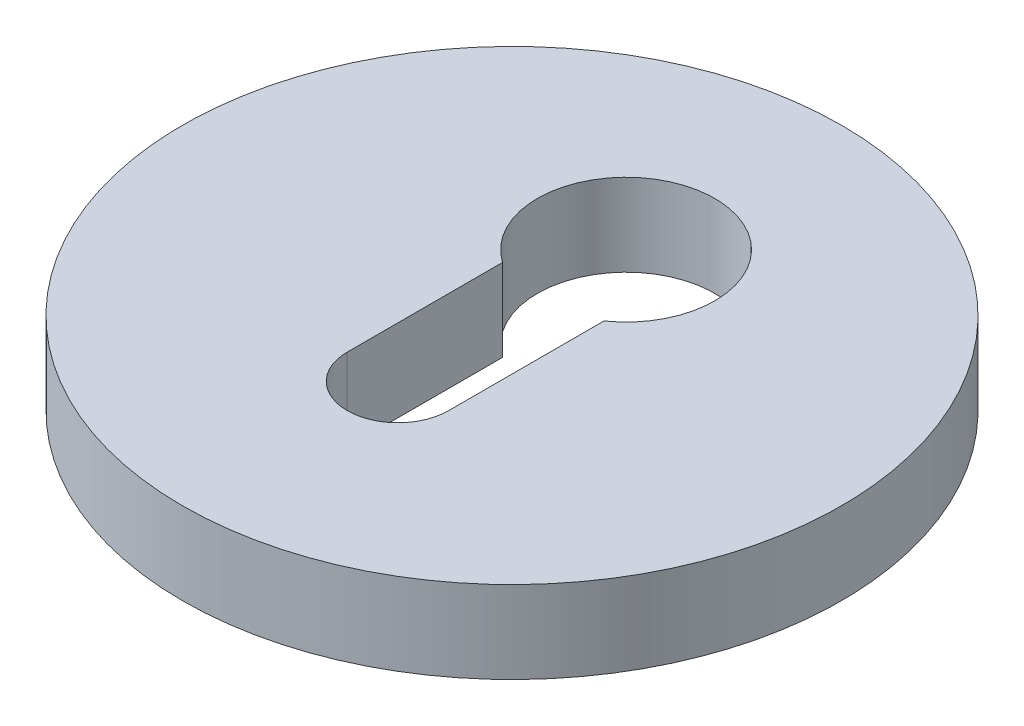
ISO-10303-21;
HEADER;
FILE_DESCRIPTION(('STEP AP214'),'2;1');
FILE_NAME('part.step','',(''),(''),'','','');
FILE_SCHEMA(('AUTOMOTIVE_DESIGN { 1 0 10303 214 1 1 1 1 }'));
ENDSEC;
DATA;
#1=APPLICATION_CONTEXT('core data for automotive mechanical design processes');
#2=APPLICATION_PROTOCOL_DEFINITION('international standard','automotive_design',2000,#1);
#3=PRODUCT_CONTEXT('',#1,'mechanical');
#4=PRODUCT('Part','Part','',(#3));
#5=PRODUCT_RELATED_PRODUCT_CATEGORY('part','',(#4));
#6=PRODUCT_DEFINITION_FORMATION('','',#4);
#7=PRODUCT_DEFINITION_CONTEXT('part definition',#1,'design');
#8=PRODUCT_DEFINITION('design','',#6,#7);
#9=PRODUCT_DEFINITION_SHAPE('','',#8);
#10=(LENGTH_UNIT() NAMED_UNIT(*) SI_UNIT(.MILLI.,.METRE.));
#11=(NAMED_UNIT(*) PLANE_ANGLE_UNIT() SI_UNIT($,.RADIAN.));
#12=(NAMED_UNIT(*) SI_UNIT($,.STERADIAN.) SOLID_ANGLE_UNIT());
#13=UNCERTAINTY_MEASURE_WITH_UNIT(LENGTH_MEASURE(1.E-05),#10,'distance_accuracy_value','');
#14=(GEOMETRIC_REPRESENTATION_CONTEXT(3) GLOBAL_UNCERTAINTY_ASSIGNED_CONTEXT((#13)) GLOBAL_UNIT_ASSIGNED_CONTEXT((#10,
#11,#12)) REPRESENTATION_CONTEXT('',''));
#15=CARTESIAN_POINT('',(0.,0.,0.));
#16=DIRECTION('',(0.,0.,1.));
#17=DIRECTION('',(1.,0.,0.));
#18=AXIS2_PLACEMENT_3D('',#15,#16,#17);
#19=CARTESIAN_POINT('',(0.,4.12060591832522,0.));
#20=DIRECTION('',(0.,-1.,0.));
#21=DIRECTION('',(0.,0.,-1.));
#22=AXIS2_PLACEMENT_3D('',#19,#20,#21);
#23=CYLINDRICAL_SURFACE('',#22,16.51);
#24=CARTESIAN_POINT('',(0.,4.12060591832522,0.));
#25=DIRECTION('',(0.,1.,0.));
#26=DIRECTION('',(0.,0.,1.));
#27=AXIS2_PLACEMENT_3D('',#24,#25,#26);
#28=CIRCLE('',#27,16.51);
#29=CARTESIAN_POINT('',(0.,4.12060591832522,16.51));
#30=VERTEX_POINT('',#29);
#31=EDGE_CURVE('E102',#30,#30,#28,.T.);
#32=ORIENTED_EDGE('',*,*,#31,.F.);
#33=EDGE_LOOP('',(#32));
#34=FACE_BOUND('',#33,.T.);
#35=CARTESIAN_POINT('',(0.,0.,0.));
#36=DIRECTION('',(0.,1.,0.));
#37=DIRECTION('',(0.,0.,1.));
#38=AXIS2_PLACEMENT_3D('',#35,#36,#37);
#39=CIRCLE('',#38,16.51);
#40=CARTESIAN_POINT('',(0.,0.,16.51));
#41=VERTEX_POINT('',#40);
#42=EDGE_CURVE('E99',#41,#41,#39,.T.);
#43=ORIENTED_EDGE('',*,*,#42,.T.);
#44=EDGE_LOOP('',(#43));
#45=FACE_BOUND('',#44,.T.);
#46=ADVANCED_FACE('F33',(#34,#45),#23,.T.);
#47=CARTESIAN_POINT('',(0.,4.12060591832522,0.));
#48=DIRECTION('',(0.,1.,0.));
#49=DIRECTION('',(0.,0.,1.));
#50=AXIS2_PLACEMENT_3D('',#47,#48,#49);
#51=PLANE('',#50);
#52=CARTESIAN_POINT('',(0.,4.12060591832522,-5.715));
#53=DIRECTION('',(0.,1.,0.));
#54=DIRECTION('',(0.,0.,1.));
#55=AXIS2_PLACEMENT_3D('',#52,#53,#54);
#56=CIRCLE('',#55,4.445);
#57=CARTESIAN_POINT('',(2.54,4.12060591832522,-2.06720271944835));
#58=VERTEX_POINT('',#57);
#59=CARTESIAN_POINT('',(-2.54,4.12060591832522,-2.06720271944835));
#60=VERTEX_POINT('',#59);
#61=EDGE_CURVE('E47',#58,#60,#56,.T.);
#62=ORIENTED_EDGE('',*,*,#61,.F.);
#63=DIRECTION('',(0.,0.,1.));
#64=VECTOR('',#63,1.);
#65=CARTESIAN_POINT('',(2.54,4.12060591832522,0.));
#66=LINE('',#65,#64);
#67=CARTESIAN_POINT('',(2.54,4.12060591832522,5.715));
#68=VERTEX_POINT('',#67);
#69=EDGE_CURVE('E92',#58,#68,#66,.T.);
#70=ORIENTED_EDGE('',*,*,#69,.T.);
#71=CARTESIAN_POINT('',(0.,4.12060591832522,5.715));
#72=DIRECTION('',(0.,1.,0.));
#73=DIRECTION('',(0.,0.,1.));
#74=AXIS2_PLACEMENT_3D('',#71,#72,#73);
#75=CIRCLE('',#74,2.54);
#76=CARTESIAN_POINT('',(-2.54,4.12060591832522,5.715));
#77=VERTEX_POINT('',#76);
#78=EDGE_CURVE('E76',#77,#68,#75,.T.);
#79=ORIENTED_EDGE('',*,*,#78,.F.);
#80=DIRECTION('',(0.,0.,1.));
#81=VECTOR('',#80,1.);
#82=CARTESIAN_POINT('',(-2.54,4.12060591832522,0.));
#83=LINE('',#82,#81);
#84=EDGE_CURVE('E85',#60,#77,#83,.T.);
#85=ORIENTED_EDGE('',*,*,#84,.F.);
#86=EDGE_LOOP('',(#62,#70,#79,#85));
#87=FACE_BOUND('',#86,.T.);
#88=ORIENTED_EDGE('',*,*,#31,.T.);
#89=EDGE_LOOP('',(#88));
#90=FACE_BOUND('',#89,.T.);
#91=ADVANCED_FACE('F89',(#87,#90),#51,.T.);
#92=CARTESIAN_POINT('',(0.,0.,0.));
#93=DIRECTION('',(0.,1.,0.));
#94=DIRECTION('',(0.,0.,1.));
#95=AXIS2_PLACEMENT_3D('',#92,#93,#94);
#96=PLANE('',#95);
#97=DIRECTION('',(0.,0.,1.));
#98=VECTOR('',#97,1.);
#99=CARTESIAN_POINT('',(2.54,0.,0.));
#100=LINE('',#99,#98);
#101=CARTESIAN_POINT('',(2.54,0.,-2.06720271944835));
#102=VERTEX_POINT('',#101);
#103=CARTESIAN_POINT('',(2.54,0.,5.715));
#104=VERTEX_POINT('',#103);
#105=EDGE_CURVE('E40',#102,#104,#100,.T.);
#106=ORIENTED_EDGE('',*,*,#105,.F.);
#107=CARTESIAN_POINT('',(0.,0.,-5.715));
#108=DIRECTION('',(0.,1.,0.));
#109=DIRECTION('',(0.,0.,1.));
#110=AXIS2_PLACEMENT_3D('',#107,#108,#109);
#111=CIRCLE('',#110,4.445);
#112=CARTESIAN_POINT('',(-2.54,0.,-2.06720271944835));
#113=VERTEX_POINT('',#112);
#114=EDGE_CURVE('E11',#102,#113,#111,.T.);
#115=ORIENTED_EDGE('',*,*,#114,.T.);
#116=DIRECTION('',(0.,0.,1.));
#117=VECTOR('',#116,1.);
#118=CARTESIAN_POINT('',(-2.54,0.,0.));
#119=LINE('',#118,#117);
#120=CARTESIAN_POINT('',(-2.54,0.,5.715));
#121=VERTEX_POINT('',#120);
#122=EDGE_CURVE('E105',#113,#121,#119,.T.);
#123=ORIENTED_EDGE('',*,*,#122,.T.);
#124=CARTESIAN_POINT('',(0.,0.,5.715));
#125=DIRECTION('',(0.,1.,0.));
#126=DIRECTION('',(0.,0.,1.));
#127=AXIS2_PLACEMENT_3D('',#124,#125,#126);
#128=CIRCLE('',#127,2.54);
#129=EDGE_CURVE('E79',#121,#104,#128,.T.);
#130=ORIENTED_EDGE('',*,*,#129,.T.);
#131=EDGE_LOOP('',(#106,#115,#123,#130));
#132=FACE_BOUND('',#131,.T.);
#133=ORIENTED_EDGE('',*,*,#42,.F.);
#134=EDGE_LOOP('',(#133));
#135=FACE_BOUND('',#134,.T.);
#136=ADVANCED_FACE('F114',(#132,#135),#96,.F.);
#137=CARTESIAN_POINT('',(0.,-21.2793940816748,-5.715));
#138=DIRECTION('',(0.,1.,0.));
#139=DIRECTION('',(0.,0.,1.));
#140=AXIS2_PLACEMENT_3D('',#137,#138,#139);
#141=CYLINDRICAL_SURFACE('',#140,4.445);
#142=DIRECTION('',(0.,1.,0.));
#143=VECTOR('',#142,1.);
#144=CARTESIAN_POINT('',(2.54,-21.2793940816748,-2.06720271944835));
#145=LINE('',#144,#143);
#146=EDGE_CURVE('E97',#102,#58,#145,.T.);
#147=ORIENTED_EDGE('',*,*,#146,.T.);
#148=ORIENTED_EDGE('',*,*,#61,.T.);
#149=DIRECTION('',(0.,1.,0.));
#150=VECTOR('',#149,1.);
#151=CARTESIAN_POINT('',(-2.54,-21.2793940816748,-2.06720271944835));
#152=LINE('',#151,#150);
#153=EDGE_CURVE('E82',#113,#60,#152,.T.);
#154=ORIENTED_EDGE('',*,*,#153,.F.);
#155=ORIENTED_EDGE('',*,*,#114,.F.);
#156=EDGE_LOOP('',(#147,#148,#154,#155));
#157=FACE_BOUND('',#156,.T.);
#158=ADVANCED_FACE('F116',(#157),#141,.F.);
#159=CARTESIAN_POINT('',(2.54,-21.2793940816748,0.));
#160=DIRECTION('',(-1.,0.,0.));
#161=DIRECTION('',(0.,0.,1.));
#162=AXIS2_PLACEMENT_3D('',#159,#160,#161);
#163=PLANE('',#162);
#164=ORIENTED_EDGE('',*,*,#105,.T.);
#165=DIRECTION('',(0.,1.,0.));
#166=VECTOR('',#165,1.);
#167=CARTESIAN_POINT('',(2.54,-21.2793940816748,5.715));
#168=LINE('',#167,#166);
#169=EDGE_CURVE('E81',#104,#68,#168,.T.);
#170=ORIENTED_EDGE('',*,*,#169,.T.);
#171=ORIENTED_EDGE('',*,*,#69,.F.);
#172=ORIENTED_EDGE('',*,*,#146,.F.);
#173=EDGE_LOOP('',(#164,#170,#171,#172));
#174=FACE_BOUND('',#173,.T.);
#175=ADVANCED_FACE('F112',(#174),#163,.T.);
#176=CARTESIAN_POINT('',(0.,-21.2793940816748,5.715));
#177=DIRECTION('',(0.,1.,0.));
#178=DIRECTION('',(0.,0.,1.));
#179=AXIS2_PLACEMENT_3D('',#176,#177,#178);
#180=CYLINDRICAL_SURFACE('',#179,2.54);
#181=DIRECTION('',(0.,1.,0.));
#182=VECTOR('',#181,1.);
#183=CARTESIAN_POINT('',(-2.54,-21.2793940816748,5.715));
#184=LINE('',#183,#182);
#185=EDGE_CURVE('E55',#121,#77,#184,.T.);
#186=ORIENTED_EDGE('',*,*,#185,.T.);
#187=ORIENTED_EDGE('',*,*,#78,.T.);
#188=ORIENTED_EDGE('',*,*,#169,.F.);
#189=ORIENTED_EDGE('',*,*,#129,.F.);
#190=EDGE_LOOP('',(#186,#187,#188,#189));
#191=FACE_BOUND('',#190,.T.);
#192=ADVANCED_FACE('F73',(#191),#180,.F.);
#193=CARTESIAN_POINT('',(-2.54,-21.2793940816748,0.));
#194=DIRECTION('',(-1.,0.,0.));
#195=DIRECTION('',(0.,0.,1.));
#196=AXIS2_PLACEMENT_3D('',#193,#194,#195);
#197=PLANE('',#196);
#198=ORIENTED_EDGE('',*,*,#153,.T.);
#199=ORIENTED_EDGE('',*,*,#84,.T.);
#200=ORIENTED_EDGE('',*,*,#185,.F.);
#201=ORIENTED_EDGE('',*,*,#122,.F.);
#202=EDGE_LOOP('',(#198,#199,#200,#201));
#203=FACE_BOUND('',#202,.T.);
#204=ADVANCED_FACE('F86',(#203),#197,.F.);
#205=CLOSED_SHELL('',(#46,#91,#136,#158,#175,#192,#204));
#206=MANIFOLD_SOLID_BREP('B2',#205);
#207=ADVANCED_BREP_SHAPE_REPRESENTATION('',(#18,#206),#14);
#208=SHAPE_DEFINITION_REPRESENTATION(#9,#207);
ENDSEC;
END-ISO-10303-21;
